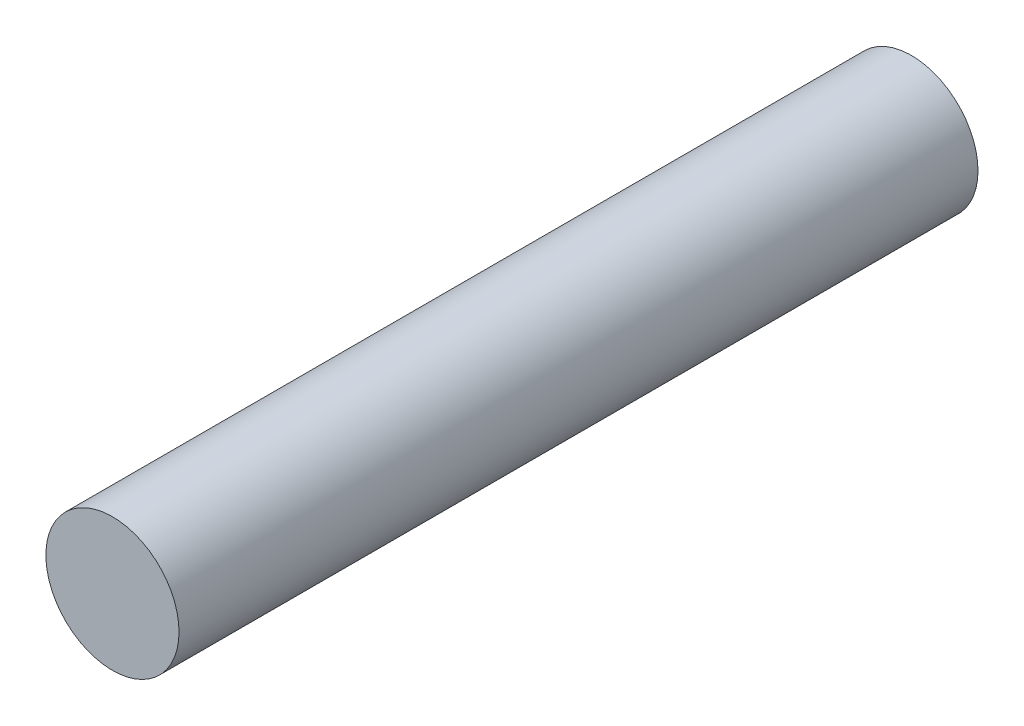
from build123d import *

# Parameters (mm, degrees)
ESQUISSE1_R        = 2.5
BOSS_EXTRU_1_DEPTH = 30


with BuildPart() as part:
    # Esquisse1 → Boss.-Extru.1 (new body)
    with BuildSketch(Plane.XY):
        Circle(ESQUISSE1_R)
    extrude(amount=BOSS_EXTRU_1_DEPTH)


solid = part.part
